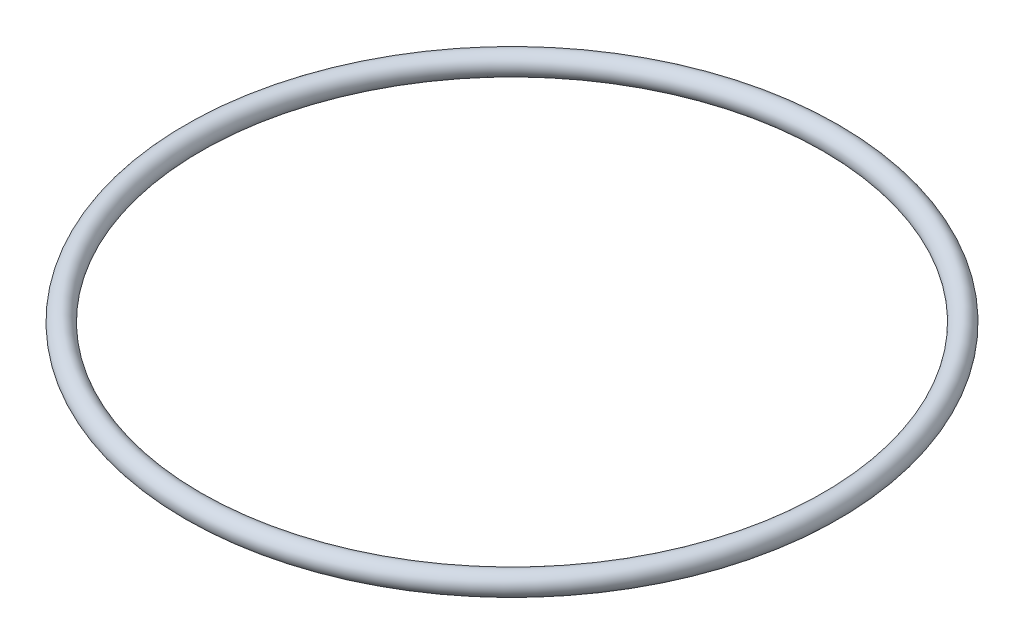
from build123d import *

# Parameters (mm, degrees)
SKETCH2_R = 0.889


with BuildPart() as part:
    # Sweep1: sweep along a path in Sketch1
    with BuildLine(Plane(origin=(0, 0, 0), x_dir=(1, 0, 0), z_dir=(0, 1, 0))) as sweep1_path:
        CenterArc((0, 0), 25.4, 0, 360)
    # Sketch2 → Sweep1 (sweep)
    with BuildSketch(Plane.XY):
        with Locations((-26.289, 0)):
            Circle(SKETCH2_R)
    sweep(path=sweep1_path.line)


solid = part.part
